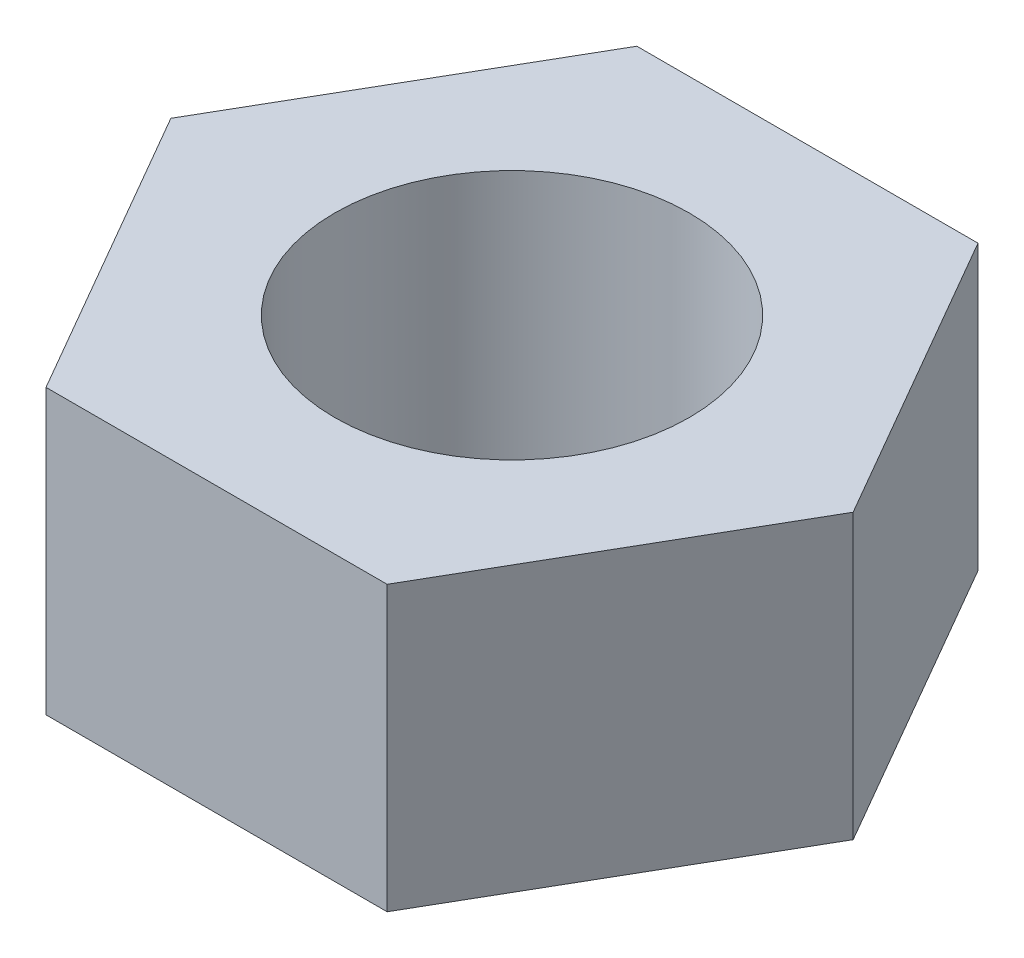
ISO-10303-21;
HEADER;
FILE_DESCRIPTION(('STEP AP214'),'2;1');
FILE_NAME('part.step','',(''),(''),'','','');
FILE_SCHEMA(('AUTOMOTIVE_DESIGN { 1 0 10303 214 1 1 1 1 }'));
ENDSEC;
DATA;
#1=APPLICATION_CONTEXT('core data for automotive mechanical design processes');
#2=APPLICATION_PROTOCOL_DEFINITION('international standard','automotive_design',2000,#1);
#3=PRODUCT_CONTEXT('',#1,'mechanical');
#4=PRODUCT('Part','Part','',(#3));
#5=PRODUCT_RELATED_PRODUCT_CATEGORY('part','',(#4));
#6=PRODUCT_DEFINITION_FORMATION('','',#4);
#7=PRODUCT_DEFINITION_CONTEXT('part definition',#1,'design');
#8=PRODUCT_DEFINITION('design','',#6,#7);
#9=PRODUCT_DEFINITION_SHAPE('','',#8);
#10=(LENGTH_UNIT() NAMED_UNIT(*) SI_UNIT(.MILLI.,.METRE.));
#11=(NAMED_UNIT(*) PLANE_ANGLE_UNIT() SI_UNIT($,.RADIAN.));
#12=(NAMED_UNIT(*) SI_UNIT($,.STERADIAN.) SOLID_ANGLE_UNIT());
#13=UNCERTAINTY_MEASURE_WITH_UNIT(LENGTH_MEASURE(1.E-05),#10,'distance_accuracy_value','');
#14=(GEOMETRIC_REPRESENTATION_CONTEXT(3) GLOBAL_UNCERTAINTY_ASSIGNED_CONTEXT((#13)) GLOBAL_UNIT_ASSIGNED_CONTEXT((#10,
#11,#12)) REPRESENTATION_CONTEXT('',''));
#15=CARTESIAN_POINT('',(0.,0.,0.));
#16=DIRECTION('',(0.,0.,1.));
#17=DIRECTION('',(1.,0.,0.));
#18=AXIS2_PLACEMENT_3D('',#15,#16,#17);
#19=CARTESIAN_POINT('',(0.,4.8,0.));
#20=DIRECTION('',(0.,1.,0.));
#21=DIRECTION('',(0.,0.,1.));
#22=AXIS2_PLACEMENT_3D('',#19,#20,#21);
#23=PLANE('',#22);
#24=CARTESIAN_POINT('',(0.,4.8,0.));
#25=DIRECTION('',(0.,1.,0.));
#26=DIRECTION('',(0.,0.,1.));
#27=AXIS2_PLACEMENT_3D('',#24,#25,#26);
#28=CIRCLE('',#27,3.);
#29=CARTESIAN_POINT('',(0.,4.8,3.));
#30=VERTEX_POINT('',#29);
#31=EDGE_CURVE('E19',#30,#30,#28,.F.);
#32=ORIENTED_EDGE('',*,*,#31,.T.);
#33=EDGE_LOOP('',(#32));
#34=FACE_BOUND('',#33,.T.);
#35=DIRECTION('',(1.,0.,0.));
#36=VECTOR('',#35,1.);
#37=CARTESIAN_POINT('',(-2.886751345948,4.8,5.));
#38=LINE('',#37,#36);
#39=CARTESIAN_POINT('',(2.886751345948,4.8,5.));
#40=VERTEX_POINT('',#39);
#41=CARTESIAN_POINT('',(-2.88675134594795,4.8,4.99999999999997));
#42=VERTEX_POINT('',#41);
#43=EDGE_CURVE('E83',#40,#42,#38,.F.);
#44=ORIENTED_EDGE('',*,*,#43,.F.);
#45=DIRECTION('',(0.500000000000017,0.,-0.866025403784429));
#46=VECTOR('',#45,1.);
#47=CARTESIAN_POINT('',(2.886751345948,4.8,5.));
#48=LINE('',#47,#46);
#49=CARTESIAN_POINT('',(5.77350269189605,4.8,0.));
#50=VERTEX_POINT('',#49);
#51=EDGE_CURVE('E79',#50,#40,#48,.F.);
#52=ORIENTED_EDGE('',*,*,#51,.F.);
#53=DIRECTION('',(-0.500000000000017,0.,-0.866025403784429));
#54=VECTOR('',#53,1.);
#55=CARTESIAN_POINT('',(5.773502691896,4.8,0.));
#56=LINE('',#55,#54);
#57=CARTESIAN_POINT('',(2.88675134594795,4.8,-4.99999999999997));
#58=VERTEX_POINT('',#57);
#59=EDGE_CURVE('E70',#58,#50,#56,.F.);
#60=ORIENTED_EDGE('',*,*,#59,.F.);
#61=DIRECTION('',(-1.,0.,0.));
#62=VECTOR('',#61,1.);
#63=CARTESIAN_POINT('',(2.886751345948,4.8,-5.));
#64=LINE('',#63,#62);
#65=CARTESIAN_POINT('',(-2.886751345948,4.8,-5.));
#66=VERTEX_POINT('',#65);
#67=EDGE_CURVE('E65',#66,#58,#64,.F.);
#68=ORIENTED_EDGE('',*,*,#67,.F.);
#69=DIRECTION('',(-0.500000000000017,0.,0.866025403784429));
#70=VECTOR('',#69,1.);
#71=CARTESIAN_POINT('',(-2.886751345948,4.8,-5.));
#72=LINE('',#71,#70);
#73=CARTESIAN_POINT('',(-5.77350269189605,4.8,0.));
#74=VERTEX_POINT('',#73);
#75=EDGE_CURVE('E95',#74,#66,#72,.F.);
#76=ORIENTED_EDGE('',*,*,#75,.F.);
#77=DIRECTION('',(0.500000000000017,0.,0.866025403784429));
#78=VECTOR('',#77,1.);
#79=CARTESIAN_POINT('',(-5.773502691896,4.8,0.));
#80=LINE('',#79,#78);
#81=EDGE_CURVE('E99',#42,#74,#80,.F.);
#82=ORIENTED_EDGE('',*,*,#81,.F.);
#83=EDGE_LOOP('',(#44,#52,#60,#68,#76,#82));
#84=FACE_BOUND('',#83,.T.);
#85=ADVANCED_FACE('F16',(#34,#84),#23,.T.);
#86=CARTESIAN_POINT('',(2.886751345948,0.,5.));
#87=DIRECTION('',(0.866025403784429,0.,0.500000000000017));
#88=DIRECTION('',(0.500000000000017,0.,-0.866025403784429));
#89=AXIS2_PLACEMENT_3D('',#86,#87,#88);
#90=PLANE('',#89);
#91=DIRECTION('',(0.,1.,0.));
#92=VECTOR('',#91,1.);
#93=CARTESIAN_POINT('',(2.886751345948,0.,5.));
#94=LINE('',#93,#92);
#95=CARTESIAN_POINT('',(2.886751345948,0.,5.));
#96=VERTEX_POINT('',#95);
#97=EDGE_CURVE('E103',#96,#40,#94,.T.);
#98=ORIENTED_EDGE('',*,*,#97,.F.);
#99=DIRECTION('',(0.499999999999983,0.,-0.866025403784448));
#100=VECTOR('',#99,1.);
#101=CARTESIAN_POINT('',(2.886751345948,0.,5.));
#102=LINE('',#101,#100);
#103=CARTESIAN_POINT('',(5.7735026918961,0.,0.));
#104=VERTEX_POINT('',#103);
#105=EDGE_CURVE('E90',#96,#104,#102,.T.);
#106=ORIENTED_EDGE('',*,*,#105,.T.);
#107=DIRECTION('',(0.,1.,0.));
#108=VECTOR('',#107,1.);
#109=CARTESIAN_POINT('',(5.773502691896,0.,0.));
#110=LINE('',#109,#108);
#111=EDGE_CURVE('E75',#50,#104,#110,.F.);
#112=ORIENTED_EDGE('',*,*,#111,.F.);
#113=ORIENTED_EDGE('',*,*,#51,.T.);
#114=EDGE_LOOP('',(#98,#106,#112,#113));
#115=FACE_BOUND('',#114,.T.);
#116=ADVANCED_FACE('F89',(#115),#90,.T.);
#117=CARTESIAN_POINT('',(5.773502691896,0.,0.));
#118=DIRECTION('',(0.866025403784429,0.,-0.500000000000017));
#119=DIRECTION('',(-0.500000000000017,0.,-0.866025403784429));
#120=AXIS2_PLACEMENT_3D('',#117,#118,#119);
#121=PLANE('',#120);
#122=ORIENTED_EDGE('',*,*,#111,.T.);
#123=DIRECTION('',(-0.499999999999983,0.,-0.866025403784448));
#124=VECTOR('',#123,1.);
#125=CARTESIAN_POINT('',(5.773502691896,0.,0.));
#126=LINE('',#125,#124);
#127=CARTESIAN_POINT('',(2.8867513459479,0.,-4.99999999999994));
#128=VERTEX_POINT('',#127);
#129=EDGE_CURVE('E108',#104,#128,#126,.T.);
#130=ORIENTED_EDGE('',*,*,#129,.T.);
#131=DIRECTION('',(0.,1.,0.));
#132=VECTOR('',#131,1.);
#133=CARTESIAN_POINT('',(2.886751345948,0.,-5.));
#134=LINE('',#133,#132);
#135=EDGE_CURVE('E77',#58,#128,#134,.F.);
#136=ORIENTED_EDGE('',*,*,#135,.F.);
#137=ORIENTED_EDGE('',*,*,#59,.T.);
#138=EDGE_LOOP('',(#122,#130,#136,#137));
#139=FACE_BOUND('',#138,.T.);
#140=ADVANCED_FACE('F72',(#139),#121,.T.);
#141=CARTESIAN_POINT('',(2.886751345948,0.,-5.));
#142=DIRECTION('',(0.,0.,-1.));
#143=DIRECTION('',(-1.,0.,0.));
#144=AXIS2_PLACEMENT_3D('',#141,#142,#143);
#145=PLANE('',#144);
#146=ORIENTED_EDGE('',*,*,#135,.T.);
#147=DIRECTION('',(1.,0.,0.));
#148=VECTOR('',#147,1.);
#149=CARTESIAN_POINT('',(0.,0.,-5.));
#150=LINE('',#149,#148);
#151=CARTESIAN_POINT('',(-2.886751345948,0.,-5.));
#152=VERTEX_POINT('',#151);
#153=EDGE_CURVE('E110',#128,#152,#150,.F.);
#154=ORIENTED_EDGE('',*,*,#153,.T.);
#155=DIRECTION('',(0.,1.,0.));
#156=VECTOR('',#155,1.);
#157=CARTESIAN_POINT('',(-2.886751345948,0.,-5.));
#158=LINE('',#157,#156);
#159=EDGE_CURVE('E97',#66,#152,#158,.F.);
#160=ORIENTED_EDGE('',*,*,#159,.F.);
#161=ORIENTED_EDGE('',*,*,#67,.T.);
#162=EDGE_LOOP('',(#146,#154,#160,#161));
#163=FACE_BOUND('',#162,.T.);
#164=ADVANCED_FACE('F131',(#163),#145,.T.);
#165=CARTESIAN_POINT('',(-2.886751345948,0.,-5.));
#166=DIRECTION('',(-0.866025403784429,0.,-0.500000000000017));
#167=DIRECTION('',(-0.500000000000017,0.,0.866025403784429));
#168=AXIS2_PLACEMENT_3D('',#165,#166,#167);
#169=PLANE('',#168);
#170=ORIENTED_EDGE('',*,*,#159,.T.);
#171=DIRECTION('',(-0.499999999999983,0.,0.866025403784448));
#172=VECTOR('',#171,1.);
#173=CARTESIAN_POINT('',(-2.886751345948,0.,-5.));
#174=LINE('',#173,#172);
#175=CARTESIAN_POINT('',(-5.7735026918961,0.,0.));
#176=VERTEX_POINT('',#175);
#177=EDGE_CURVE('E113',#152,#176,#174,.T.);
#178=ORIENTED_EDGE('',*,*,#177,.T.);
#179=DIRECTION('',(0.,1.,0.));
#180=VECTOR('',#179,1.);
#181=CARTESIAN_POINT('',(-5.773502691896,0.,0.));
#182=LINE('',#181,#180);
#183=EDGE_CURVE('E101',#74,#176,#182,.F.);
#184=ORIENTED_EDGE('',*,*,#183,.F.);
#185=ORIENTED_EDGE('',*,*,#75,.T.);
#186=EDGE_LOOP('',(#170,#178,#184,#185));
#187=FACE_BOUND('',#186,.T.);
#188=ADVANCED_FACE('F129',(#187),#169,.T.);
#189=CARTESIAN_POINT('',(-5.773502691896,0.,0.));
#190=DIRECTION('',(-0.866025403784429,0.,0.500000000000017));
#191=DIRECTION('',(0.500000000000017,0.,0.866025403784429));
#192=AXIS2_PLACEMENT_3D('',#189,#190,#191);
#193=PLANE('',#192);
#194=ORIENTED_EDGE('',*,*,#183,.T.);
#195=DIRECTION('',(0.499999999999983,0.,0.866025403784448));
#196=VECTOR('',#195,1.);
#197=CARTESIAN_POINT('',(-5.773502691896,0.,0.));
#198=LINE('',#197,#196);
#199=CARTESIAN_POINT('',(-2.8867513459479,0.,4.99999999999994));
#200=VERTEX_POINT('',#199);
#201=EDGE_CURVE('E116',#176,#200,#198,.T.);
#202=ORIENTED_EDGE('',*,*,#201,.T.);
#203=DIRECTION('',(0.,1.,0.));
#204=VECTOR('',#203,1.);
#205=CARTESIAN_POINT('',(-2.886751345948,0.,5.));
#206=LINE('',#205,#204);
#207=EDGE_CURVE('E33',#42,#200,#206,.F.);
#208=ORIENTED_EDGE('',*,*,#207,.F.);
#209=ORIENTED_EDGE('',*,*,#81,.T.);
#210=EDGE_LOOP('',(#194,#202,#208,#209));
#211=FACE_BOUND('',#210,.T.);
#212=ADVANCED_FACE('F125',(#211),#193,.T.);
#213=CARTESIAN_POINT('',(-2.886751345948,0.,5.));
#214=DIRECTION('',(0.,0.,1.));
#215=DIRECTION('',(1.,0.,0.));
#216=AXIS2_PLACEMENT_3D('',#213,#214,#215);
#217=PLANE('',#216);
#218=ORIENTED_EDGE('',*,*,#207,.T.);
#219=DIRECTION('',(1.,0.,0.));
#220=VECTOR('',#219,1.);
#221=CARTESIAN_POINT('',(0.,0.,5.));
#222=LINE('',#221,#220);
#223=EDGE_CURVE('E25',#200,#96,#222,.T.);
#224=ORIENTED_EDGE('',*,*,#223,.T.);
#225=ORIENTED_EDGE('',*,*,#97,.T.);
#226=ORIENTED_EDGE('',*,*,#43,.T.);
#227=EDGE_LOOP('',(#218,#224,#225,#226));
#228=FACE_BOUND('',#227,.T.);
#229=ADVANCED_FACE('F119',(#228),#217,.T.);
#230=CARTESIAN_POINT('',(0.,0.,0.));
#231=DIRECTION('',(0.,1.,0.));
#232=DIRECTION('',(0.,0.,1.));
#233=AXIS2_PLACEMENT_3D('',#230,#231,#232);
#234=CYLINDRICAL_SURFACE('',#233,3.);
#235=ORIENTED_EDGE('',*,*,#31,.F.);
#236=EDGE_LOOP('',(#235));
#237=FACE_BOUND('',#236,.T.);
#238=CARTESIAN_POINT('',(0.,0.,0.));
#239=DIRECTION('',(0.,1.,0.));
#240=DIRECTION('',(0.,0.,1.));
#241=AXIS2_PLACEMENT_3D('',#238,#239,#240);
#242=CIRCLE('',#241,3.);
#243=CARTESIAN_POINT('',(0.,0.,3.));
#244=VERTEX_POINT('',#243);
#245=EDGE_CURVE('E11',#244,#244,#242,.F.);
#246=ORIENTED_EDGE('',*,*,#245,.T.);
#247=EDGE_LOOP('',(#246));
#248=FACE_BOUND('',#247,.T.);
#249=ADVANCED_FACE('F142',(#237,#248),#234,.F.);
#250=CARTESIAN_POINT('',(0.,0.,0.));
#251=DIRECTION('',(0.,1.,0.));
#252=DIRECTION('',(0.,0.,1.));
#253=AXIS2_PLACEMENT_3D('',#250,#251,#252);
#254=PLANE('',#253);
#255=ORIENTED_EDGE('',*,*,#245,.F.);
#256=EDGE_LOOP('',(#255));
#257=FACE_BOUND('',#256,.T.);
#258=ORIENTED_EDGE('',*,*,#201,.F.);
#259=ORIENTED_EDGE('',*,*,#177,.F.);
#260=ORIENTED_EDGE('',*,*,#153,.F.);
#261=ORIENTED_EDGE('',*,*,#129,.F.);
#262=ORIENTED_EDGE('',*,*,#105,.F.);
#263=ORIENTED_EDGE('',*,*,#223,.F.);
#264=EDGE_LOOP('',(#258,#259,#260,#261,#262,#263));
#265=FACE_BOUND('',#264,.T.);
#266=ADVANCED_FACE('F122',(#257,#265),#254,.F.);
#267=CLOSED_SHELL('',(#85,#116,#140,#164,#188,#212,#229,#249,#266));
#268=MANIFOLD_SOLID_BREP('B1',#267);
#269=ADVANCED_BREP_SHAPE_REPRESENTATION('',(#18,#268),#14);
#270=SHAPE_DEFINITION_REPRESENTATION(#9,#269);
ENDSEC;
END-ISO-10303-21;
